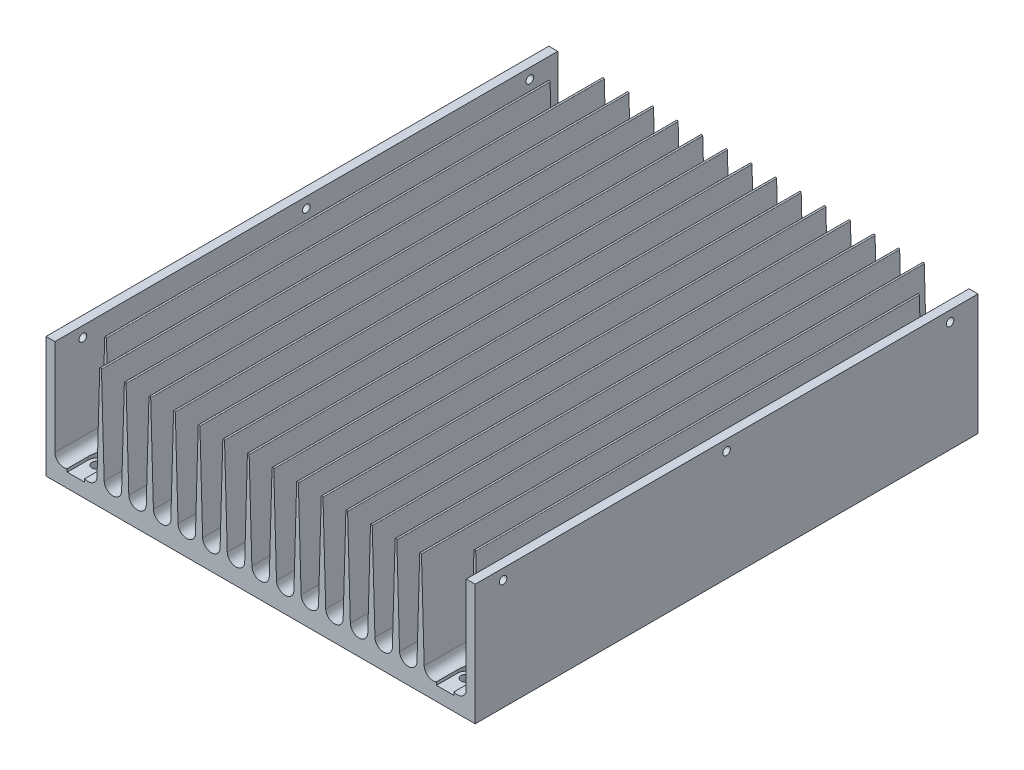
from build123d import *

# Parameters (mm, degrees)
BOSS_EXTRUDE1_DEPTH                            = 114.3
CBORE_FOR_8_SOCKET_HEAD_CAP_SCREW1_D           = 4.4958
CBORE_FOR_8_SOCKET_HEAD_CAP_SCREW1_CBORE_D     = 7.9375
CBORE_FOR_8_SOCKET_HEAD_CAP_SCREW1_CBORE_DEPTH = 48.6156
SKETCH4_W                                      = 7.9375
SKETCH4_H                                      = 48.6156
CUT_EXTRUDE2_DEPTH                             = 9.525
MIRROR2_COPY_1_SKETCH_W                        = 7.9375
MIRROR2_COPY_1_SKETCH_H                        = 48.6156
MIRROR2_COPY_1_DEPTH                           = 9.525
F_8_32_TAPPED_HOLE1_REACH                      = 234.726
F_8_32_TAPPED_HOLE1_BORE_R                     = 1.7272


with BuildPart() as part:
    # Sketch1 → Boss-Extrude1 (new, symmetric)
    with BuildSketch(Plane.XY):
        with BuildLine():
            Line((-97.5614, 54.991), (-97.5614, 0))
            Line((-97.5614, 0), (97.5614, 0))
            Line((97.5614, 0), (97.5614, 54.991))
            Line((97.5614, 54.991), (93.4974, 54.991))
            Line((93.4974, 54.991), (93.4974, 11.38555))
            ThreePointArc((93.4974, 11.38555), (89.585036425, 7.417200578), (85.561502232, 11.272788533))
            Line((85.561502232, 11.272788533), (84.329824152, 54.605401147))
            ThreePointArc((84.329824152, 54.605401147), (83.933109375, 54.991), (83.536394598, 54.605401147))
            Line((83.536394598, 54.605401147), (82.304716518, 11.272788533))
            ThreePointArc((82.304716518, 11.272788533), (78.33756875, 7.4168), (74.370420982, 11.272788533))
            Line((74.370420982, 11.272788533), (73.138742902, 54.605401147))
            ThreePointArc((73.138742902, 54.605401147), (72.742028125, 54.991), (72.345313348, 54.605401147))
            Line((72.345313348, 54.605401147), (71.113635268, 11.272788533))
            ThreePointArc((71.113635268, 11.272788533), (67.1464875, 7.4168), (63.179339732, 11.272788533))
            Line((63.179339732, 11.272788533), (61.947661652, 54.605401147))
            ThreePointArc((61.947661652, 54.605401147), (61.550946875, 54.991), (61.154232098, 54.605401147))
            Line((61.154232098, 54.605401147), (59.922554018, 11.272788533))
            ThreePointArc((59.922554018, 11.272788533), (55.95540625, 7.4168), (51.988258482, 11.272788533))
            Line((51.988258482, 11.272788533), (50.756580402, 54.605401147))
            ThreePointArc((50.756580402, 54.605401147), (50.359865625, 54.991), (49.963150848, 54.605401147))
            Line((49.963150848, 54.605401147), (48.731472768, 11.272788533))
            ThreePointArc((48.731472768, 11.272788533), (44.764325, 7.4168), (40.797177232, 11.272788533))
            Line((40.797177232, 11.272788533), (39.565499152, 54.605401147))
            ThreePointArc((39.565499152, 54.605401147), (39.168784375, 54.991), (38.772069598, 54.605401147))
            Line((38.772069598, 54.605401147), (37.540391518, 11.272788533))
            ThreePointArc((37.540391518, 11.272788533), (33.57324375, 7.4168), (29.606095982, 11.272788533))
            Line((29.606095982, 11.272788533), (28.374417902, 54.605401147))
            ThreePointArc((28.374417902, 54.605401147), (27.977703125, 54.991), (27.580988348, 54.605401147))
            Line((27.580988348, 54.605401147), (26.349310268, 11.272788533))
            ThreePointArc((26.349310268, 11.272788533), (22.3821625, 7.4168), (18.415014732, 11.272788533))
            Line((18.415014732, 11.272788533), (17.183336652, 54.605401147))
            ThreePointArc((17.183336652, 54.605401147), (16.786621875, 54.991), (16.389907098, 54.605401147))
            Line((16.389907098, 54.605401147), (15.158229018, 11.272788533))
            ThreePointArc((15.158229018, 11.272788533), (11.19108125, 7.4168), (7.223933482, 11.272788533))
            Line((7.223933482, 11.272788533), (5.992255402, 54.605401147))
            ThreePointArc((5.992255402, 54.605401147), (5.595540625, 54.991), (5.198825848, 54.605401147))
            Line((5.198825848, 54.605401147), (3.967147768, 11.272788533))
            ThreePointArc((3.967147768, 11.272788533), (0, 7.4168), (-3.967147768, 11.272788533))
            Line((-3.967147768, 11.272788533), (-5.198825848, 54.605401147))
            ThreePointArc((-5.198825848, 54.605401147), (-5.595540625, 54.991), (-5.992255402, 54.605401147))
            Line((-5.992255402, 54.605401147), (-7.223933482, 11.272788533))
            ThreePointArc((-7.223933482, 11.272788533), (-11.19108125, 7.4168), (-15.158229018, 11.272788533))
            Line((-15.158229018, 11.272788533), (-16.389907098, 54.605401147))
            ThreePointArc((-16.389907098, 54.605401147), (-16.786621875, 54.991), (-17.183336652, 54.605401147))
            Line((-17.183336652, 54.605401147), (-18.415014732, 11.272788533))
            ThreePointArc((-18.415014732, 11.272788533), (-22.3821625, 7.4168), (-26.349310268, 11.272788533))
            Line((-26.349310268, 11.272788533), (-27.580988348, 54.605401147))
            ThreePointArc((-27.580988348, 54.605401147), (-27.977703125, 54.991), (-28.374417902, 54.605401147))
            Line((-28.374417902, 54.605401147), (-29.606095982, 11.272788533))
            ThreePointArc((-29.606095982, 11.272788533), (-33.57324375, 7.4168), (-37.540391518, 11.272788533))
            Line((-37.540391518, 11.272788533), (-38.772069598, 54.605401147))
            ThreePointArc((-38.772069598, 54.605401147), (-39.168784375, 54.991), (-39.565499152, 54.605401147))
            Line((-39.565499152, 54.605401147), (-40.797177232, 11.272788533))
            ThreePointArc((-40.797177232, 11.272788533), (-44.764325, 7.4168), (-48.731472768, 11.272788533))
            Line((-48.731472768, 11.272788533), (-49.963150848, 54.605401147))
            ThreePointArc((-49.963150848, 54.605401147), (-50.359865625, 54.991), (-50.756580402, 54.605401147))
            Line((-50.756580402, 54.605401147), (-51.988258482, 11.272788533))
            ThreePointArc((-51.988258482, 11.272788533), (-55.95540625, 7.4168), (-59.922554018, 11.272788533))
            Line((-59.922554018, 11.272788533), (-61.154232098, 54.605401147))
            ThreePointArc((-61.154232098, 54.605401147), (-61.550946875, 54.991), (-61.947661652, 54.605401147))
            Line((-61.947661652, 54.605401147), (-63.179339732, 11.272788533))
            ThreePointArc((-63.179339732, 11.272788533), (-67.1464875, 7.4168), (-71.113635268, 11.272788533))
            Line((-71.113635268, 11.272788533), (-72.345313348, 54.605401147))
            ThreePointArc((-72.345313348, 54.605401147), (-72.742028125, 54.991), (-73.138742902, 54.605401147))
            Line((-73.138742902, 54.605401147), (-74.370420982, 11.272788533))
            ThreePointArc((-74.370420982, 11.272788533), (-78.33756875, 7.4168), (-82.304716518, 11.272788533))
            Line((-82.304716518, 11.272788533), (-83.536394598, 54.605401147))
            ThreePointArc((-83.536394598, 54.605401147), (-83.933109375, 54.991), (-84.329824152, 54.605401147))
            Line((-84.329824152, 54.605401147), (-85.561502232, 11.272788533))
            ThreePointArc((-85.561502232, 11.272788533), (-89.585036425, 7.417200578), (-93.4974, 11.38555))
            Line((-93.4974, 11.38555), (-93.4974, 54.991))
            Line((-93.4974, 54.991), (-97.5614, 54.991))
        make_face()
    extrude(amount=BOSS_EXTRUDE1_DEPTH, both=True)

    # CBORE for _8 Socket Head Cap Screw1 (through all)
    with Locations(Plane(origin=(0, 54.991, 0), x_dir=(1, 0, 0), z_dir=(0, 1, 0))):
        with Locations((-83.933109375, 104.775), (83.933109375, 104.775), (83.933109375, -104.775), (-83.933109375, -104.775)):
            CounterBoreHole(CBORE_FOR_8_SOCKET_HEAD_CAP_SCREW1_D / 2, CBORE_FOR_8_SOCKET_HEAD_CAP_SCREW1_CBORE_D / 2, CBORE_FOR_8_SOCKET_HEAD_CAP_SCREW1_CBORE_DEPTH)

    # Sketch4 → Cut-Extrude2 (cut)
    with BuildSketch(Plane(origin=(0, 0, -114.3), x_dir=(-1, 0, 0), z_dir=(0, 0, -1))):
        with Locations((83.933109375, 30.6832)):
            Rectangle(SKETCH4_W, SKETCH4_H)
    cut_extrude2 = extrude(amount=-CUT_EXTRUDE2_DEPTH, mode=Mode.SUBTRACT)

    # Mirror1: Cut-Extrude2 across plane
    add(cut_extrude2.mirror(Plane(origin=(0, 0, 0), x_dir=(0, 0, 1), z_dir=(1, 0, 0))), mode=Mode.SUBTRACT)

    # Mirror2: Cut-Extrude2 across plane
    add(cut_extrude2.mirror(Plane.XY), mode=Mode.SUBTRACT)

    # Mirror2 copy 1 sketch → Mirror2 copy 1 (cut)
    with BuildSketch(Plane.XY.offset(114.3)):
        with Locations((83.933109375, 30.6832)):
            Rectangle(MIRROR2_COPY_1_SKETCH_W, MIRROR2_COPY_1_SKETCH_H)
    extrude(amount=-MIRROR2_COPY_1_DEPTH, mode=Mode.SUBTRACT)

    # 8-32 Tapped Hole1 bore → 8-32 Tapped Hole1 (cut, up to next)
    with BuildSketch(Plane(origin=(97.5614, 0, 0), x_dir=(0, 0, -1), z_dir=(1, 0, 0)), mode=Mode.PRIVATE) as f_8_32_tapped_hole1_sk1:
        with Locations((-101.6, 50.2285)):
            Circle(F_8_32_TAPPED_HOLE1_BORE_R)
    f_8_32_tapped_hole1_tool1 = extrude(f_8_32_tapped_hole1_sk1.sketch, amount=-F_8_32_TAPPED_HOLE1_REACH, mode=Mode.PRIVATE) & part.part
    # 8-32 Tapped Hole1 bore → 8-32 Tapped Hole1 (cut, up to next)
    with BuildSketch(Plane(origin=(97.5614, 0, 0), x_dir=(0, 0, -1), z_dir=(1, 0, 0)), mode=Mode.PRIVATE) as f_8_32_tapped_hole1_sk2:
        with Locations((101.6, 50.2285)):
            Circle(F_8_32_TAPPED_HOLE1_BORE_R)
    f_8_32_tapped_hole1_tool2 = extrude(f_8_32_tapped_hole1_sk2.sketch, amount=-F_8_32_TAPPED_HOLE1_REACH, mode=Mode.PRIVATE) & part.part
    # 8-32 Tapped Hole1 bore → 8-32 Tapped Hole1 (cut, up to next)
    with BuildSketch(Plane(origin=(97.5614, 0, 0), x_dir=(0, 0, -1), z_dir=(1, 0, 0)), mode=Mode.PRIVATE) as f_8_32_tapped_hole1_sk3:
        with Locations((0, 50.2285)):
            Circle(F_8_32_TAPPED_HOLE1_BORE_R)
    f_8_32_tapped_hole1_tool3 = extrude(f_8_32_tapped_hole1_sk3.sketch, amount=-F_8_32_TAPPED_HOLE1_REACH, mode=Mode.PRIVATE) & part.part
    f_8_32_tapped_hole1_1 = f_8_32_tapped_hole1_tool1.solids().sort_by_distance((97.5614, 50.2285, 101.6))[0]
    add(f_8_32_tapped_hole1_1, mode=Mode.SUBTRACT)
    f_8_32_tapped_hole1_2 = f_8_32_tapped_hole1_tool2.solids().sort_by_distance((97.5614, 50.2285, -101.6))[0]
    add(f_8_32_tapped_hole1_2, mode=Mode.SUBTRACT)
    f_8_32_tapped_hole1_3 = f_8_32_tapped_hole1_tool3.solids().sort_by_distance((97.5614, 50.2285, 0))[0]
    add(f_8_32_tapped_hole1_3, mode=Mode.SUBTRACT)
    f_8_32_tapped_hole1 = f_8_32_tapped_hole1_1 + f_8_32_tapped_hole1_2 + f_8_32_tapped_hole1_3  # 8-32 Tapped Hole1 as one shape, for the pattern or mirror that repeats it

    # Mirror3: 8-32 Tapped Hole1 across plane
    add(f_8_32_tapped_hole1.mirror(Plane(origin=(0, 0, 0), x_dir=(0, 0, 1), z_dir=(1, 0, 0))), mode=Mode.SUBTRACT)


solid = part.part
